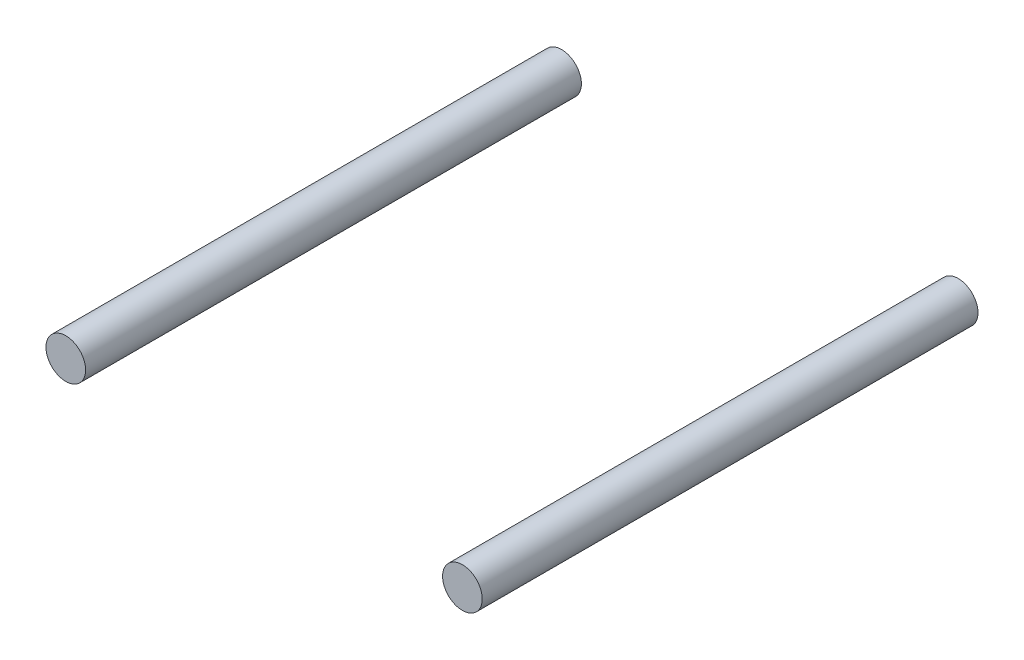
from build123d import *

# Parameters (mm, degrees)
SKETCH1_R             = 0.4
BOSS_EXTRUDE1_DEPTH   = 5
BOSS_EXTRUDE1_2_DEPTH = 5


with BuildPart() as part:
    # Sketch1 → Boss-Extrude1 (new, symmetric)
    with BuildSketch(Plane.XY):
        with Locations((-4, 0)):
            Circle(SKETCH1_R)
    extrude(amount=BOSS_EXTRUDE1_DEPTH, both=True)


with BuildPart() as body_2:
    # Sketch1 → Boss-Extrude1 2 (new, symmetric)
    with BuildSketch(Plane.XY):
        with Locations((4, 0)):
            Circle(SKETCH1_R)
    extrude(amount=BOSS_EXTRUDE1_2_DEPTH, both=True)


solid = Compound([part.part, body_2.part])
